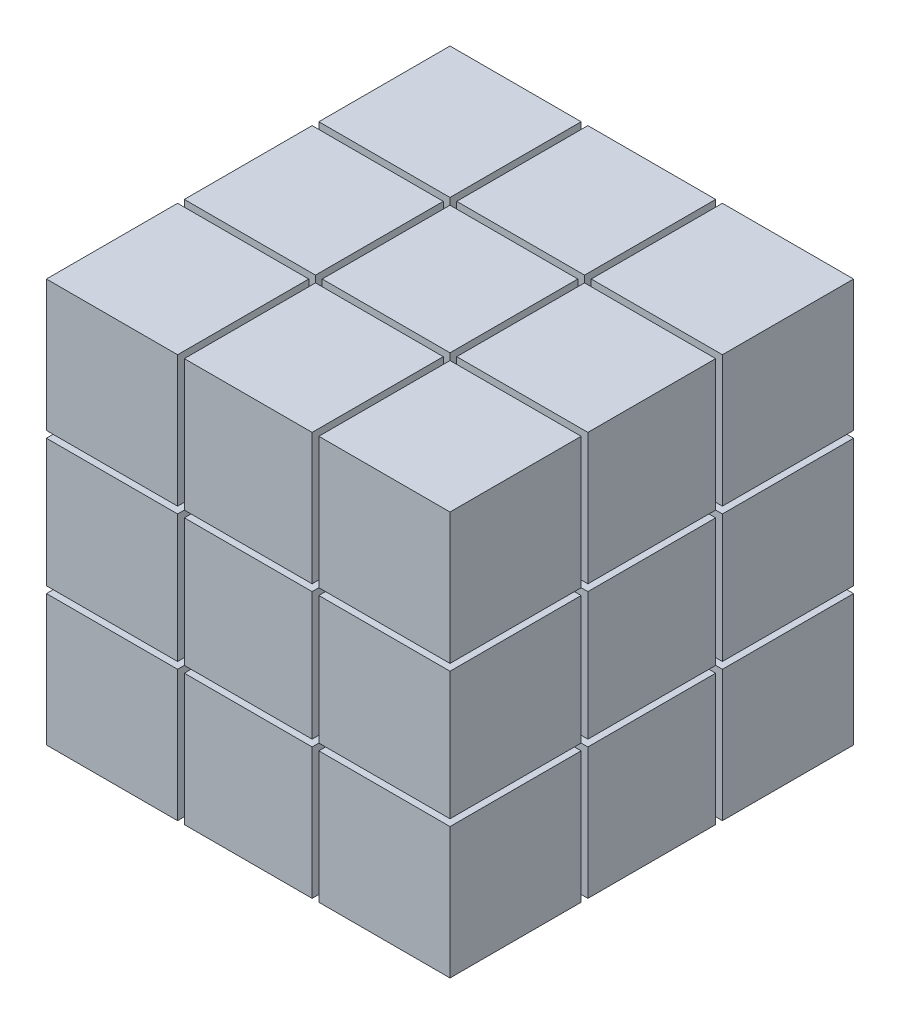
from build123d import *

# Parameters (mm, degrees)
SKETCH1_W               = 60
SKETCH1_H               = 60
BOSS_EXTRUDE2_DEPTH     = 60
SKETCH3_W               = 1
SKETCH3_H               = 71.699486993
SKETCH3_H_2             = 79.744356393
SKETCH3_W_2             = 84.183747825
SKETCH3_H_3             = 1
SKETCH3_W_3             = 96.110803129
CUT_EXTRUDE_THIN1_DEPTH = 60
SKETCH4_W               = 69.703037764
SKETCH4_H               = 1
SKETCH4_W_2             = 65.840349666
CUT_EXTRUDE_THIN2_DEPTH = 60


with BuildPart() as part:
    # Sketch1 → Boss-Extrude2 (new body)
    with BuildSketch(Plane(origin=(0, 0, 0), x_dir=(1, 0, 0), z_dir=(0, 1, 0))):
        Rectangle(SKETCH1_W, SKETCH1_H)
    extrude(amount=BOSS_EXTRUDE2_DEPTH)

    # Sketch3 → Cut-Extrude-Thin1 (cut)
    with BuildSketch(Plane(origin=(0, 60, 0), x_dir=(1, 0, 0), z_dir=(0, 1, 0))):
        with Locations((-10, 0.548423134)):
            Rectangle(SKETCH3_W, SKETCH3_H)
        with Locations((10, -0.473728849)):
            Rectangle(SKETCH3_W, SKETCH3_H_2)
        with Locations((-3.228186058, 10)):
            Rectangle(SKETCH3_W_2, SKETCH3_H_3)
        with Locations((-5.633868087, -10)):
            Rectangle(SKETCH3_W_3, SKETCH3_H_3)
    extrude(amount=-CUT_EXTRUDE_THIN1_DEPTH, mode=Mode.SUBTRACT)


with BuildPart() as cut_extrude_thin1_piece_1:
    # of the separate pieces the step leaves, piece 1, a body of its own (cut_extrude_thin1_pieces)
    add(part.part.solids().sort_by_distance((-30, 0, 10.5))[0])


with BuildPart() as cut_extrude_thin1_piece_2:
    # of the separate pieces the step leaves, piece 2, a body of its own (cut_extrude_thin1_pieces)
    add(part.part.solids().sort_by_distance((30, 0, 30))[0])


with BuildPart() as cut_extrude_thin1_piece_3:
    # of the separate pieces the step leaves, piece 3, a body of its own (cut_extrude_thin1_pieces)
    add(part.part.solids().sort_by_distance((30, 0, -30))[0])


with BuildPart() as cut_extrude_thin1_piece_4:
    # of the separate pieces the step leaves, piece 4, a body of its own (cut_extrude_thin1_pieces)
    add(part.part.solids().sort_by_distance((-10.5, 0, -30))[0])


with BuildPart() as cut_extrude_thin1_piece_5:
    # of the separate pieces the step leaves, piece 5, a body of its own (cut_extrude_thin1_pieces)
    add(part.part.solids().sort_by_distance((-9.5, 0, 30))[0])


with BuildPart() as cut_extrude_thin1_piece_6:
    # of the separate pieces the step leaves, piece 6, a body of its own (cut_extrude_thin1_pieces)
    add(part.part.solids().sort_by_distance((30, 0, 9.5))[0])


with BuildPart() as cut_extrude_thin1_piece_7:
    # of the separate pieces the step leaves, piece 7, a body of its own (cut_extrude_thin1_pieces)
    add(part.part.solids().sort_by_distance((-30, 0, -9.5))[0])


with BuildPart() as cut_extrude_thin1_piece_8:
    # of the separate pieces the step leaves, piece 8, a body of its own (cut_extrude_thin1_pieces)
    add(part.part.solids().sort_by_distance((9.5, 0, -30))[0])


with BuildPart() as cut_extrude_thin1_piece_9:
    # of the separate pieces the step leaves, piece 9, a body of its own (cut_extrude_thin1_pieces)
    add(part.part.solids().sort_by_distance((9.5, 0, -9.5))[0])


with BuildPart() as cut_extrude_thin2_tool:
    # Sketch4 → Cut-Extrude-Thin2 (new body)
    with BuildSketch(Plane(origin=(30, 0, 0), x_dir=(0, 0, -1), z_dir=(1, 0, 0))):
        with Locations((-1.226695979, 20)):
            Rectangle(SKETCH4_W, SKETCH4_H)
        with Locations((-0.765585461, 40)):
            Rectangle(SKETCH4_W_2, SKETCH4_H)
    extrude(amount=-CUT_EXTRUDE_THIN2_DEPTH)


with BuildPart() as cut_extrude_thin1_piece_1_1:
    add(cut_extrude_thin1_piece_1.part)

    # Cut-Extrude-Thin2: cut by cut_extrude_thin2_tool
    add(cut_extrude_thin2_tool.part, mode=Mode.SUBTRACT)


with BuildPart() as cut_extrude_thin1_piece_2_1:
    add(cut_extrude_thin1_piece_2.part)

    # Cut-Extrude-Thin2: cut by cut_extrude_thin2_tool
    add(cut_extrude_thin2_tool.part, mode=Mode.SUBTRACT)


with BuildPart() as cut_extrude_thin1_piece_3_1:
    add(cut_extrude_thin1_piece_3.part)

    # Cut-Extrude-Thin2: cut by cut_extrude_thin2_tool
    add(cut_extrude_thin2_tool.part, mode=Mode.SUBTRACT)


with BuildPart() as cut_extrude_thin1_piece_4_1:
    add(cut_extrude_thin1_piece_4.part)

    # Cut-Extrude-Thin2: cut by cut_extrude_thin2_tool
    add(cut_extrude_thin2_tool.part, mode=Mode.SUBTRACT)


with BuildPart() as cut_extrude_thin1_piece_5_1:
    add(cut_extrude_thin1_piece_5.part)

    # Cut-Extrude-Thin2: cut by cut_extrude_thin2_tool
    add(cut_extrude_thin2_tool.part, mode=Mode.SUBTRACT)


with BuildPart() as cut_extrude_thin1_piece_6_1:
    add(cut_extrude_thin1_piece_6.part)

    # Cut-Extrude-Thin2: cut by cut_extrude_thin2_tool
    add(cut_extrude_thin2_tool.part, mode=Mode.SUBTRACT)


with BuildPart() as cut_extrude_thin1_piece_7_1:
    add(cut_extrude_thin1_piece_7.part)

    # Cut-Extrude-Thin2: cut by cut_extrude_thin2_tool
    add(cut_extrude_thin2_tool.part, mode=Mode.SUBTRACT)


with BuildPart() as cut_extrude_thin1_piece_8_1:
    add(cut_extrude_thin1_piece_8.part)

    # Cut-Extrude-Thin2: cut by cut_extrude_thin2_tool
    add(cut_extrude_thin2_tool.part, mode=Mode.SUBTRACT)


with BuildPart() as cut_extrude_thin1_piece_9_1:
    add(cut_extrude_thin1_piece_9.part)

    # Cut-Extrude-Thin2: cut by cut_extrude_thin2_tool
    add(cut_extrude_thin2_tool.part, mode=Mode.SUBTRACT)


solid = Compound([cut_extrude_thin1_piece_1_1.part, cut_extrude_thin1_piece_2_1.part, cut_extrude_thin1_piece_3_1.part, cut_extrude_thin1_piece_4_1.part, cut_extrude_thin1_piece_5_1.part, cut_extrude_thin1_piece_6_1.part, cut_extrude_thin1_piece_7_1.part, cut_extrude_thin1_piece_8_1.part, cut_extrude_thin1_piece_9_1.part])
